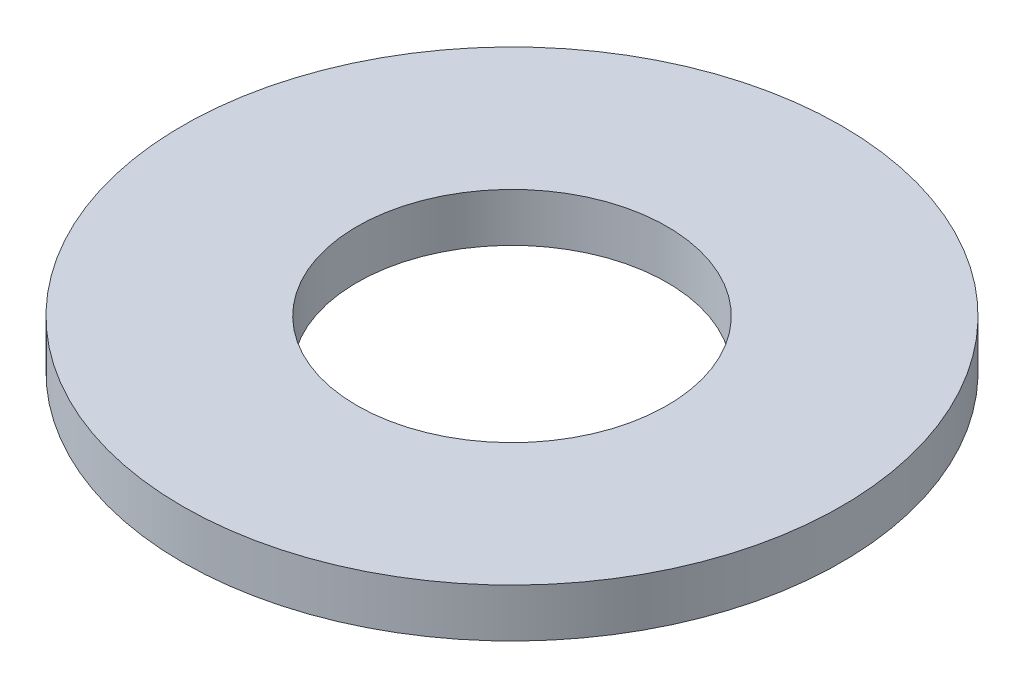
from build123d import *

# Parameters (mm, degrees)
SKETCH1_R      = 3.4
SKETCH1_R_2    = 1.6
EXTRUDE1_DEPTH = 0.5


with BuildPart() as part:
    # Sketch1 → Extrude1 (new body)
    with BuildSketch(Plane(origin=(0, 0, 0), x_dir=(1, 0, 0), z_dir=(0, 1, 0))):
        with Locations(Location((0, 0, 0), (0, 0, 270))):
            Circle(SKETCH1_R)
        with Locations(Location((0, 0, 0), (0, 0, 270))):
            Circle(SKETCH1_R_2, mode=Mode.SUBTRACT)
    extrude(amount=EXTRUDE1_DEPTH)


solid = part.part
